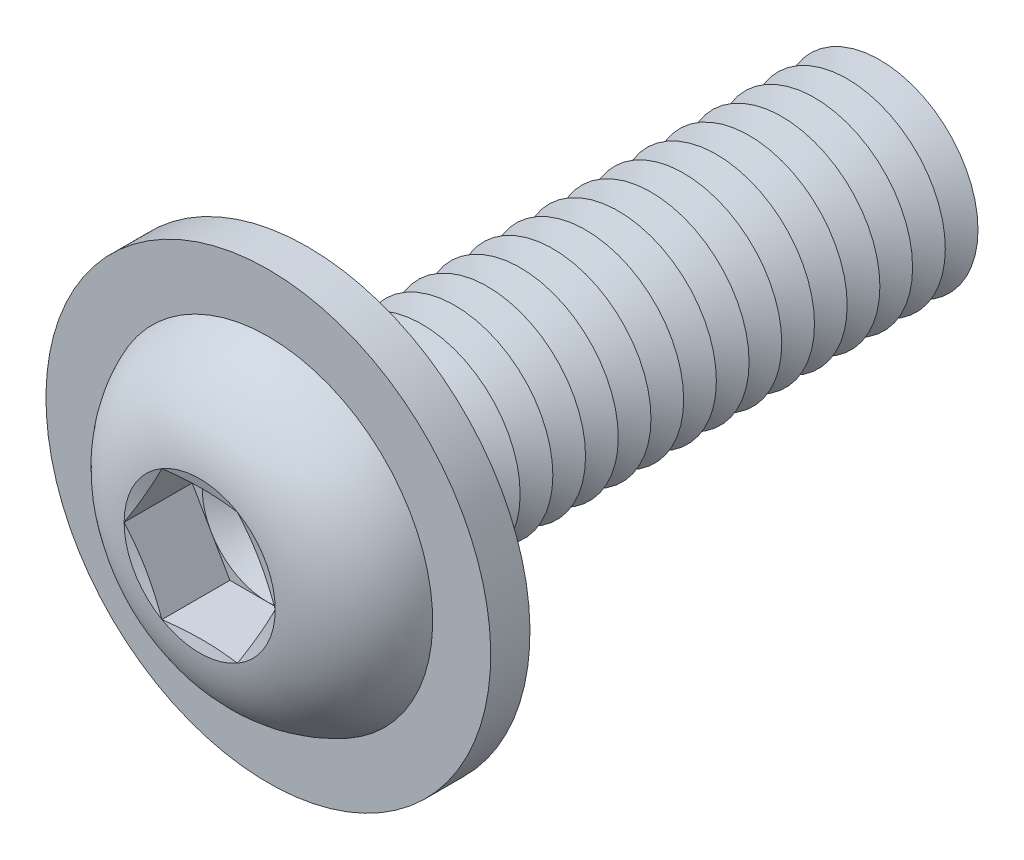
ISO-10303-21;
HEADER;
FILE_DESCRIPTION(('STEP AP214'),'2;1');
FILE_NAME('part.step','',(''),(''),'','','');
FILE_SCHEMA(('AUTOMOTIVE_DESIGN { 1 0 10303 214 1 1 1 1 }'));
ENDSEC;
DATA;
#1=APPLICATION_CONTEXT('core data for automotive mechanical design processes');
#2=APPLICATION_PROTOCOL_DEFINITION('international standard','automotive_design',2000,#1);
#3=PRODUCT_CONTEXT('',#1,'mechanical');
#4=PRODUCT('Part','Part','',(#3));
#5=PRODUCT_RELATED_PRODUCT_CATEGORY('part','',(#4));
#6=PRODUCT_DEFINITION_FORMATION('','',#4);
#7=PRODUCT_DEFINITION_CONTEXT('part definition',#1,'design');
#8=PRODUCT_DEFINITION('design','',#6,#7);
#9=PRODUCT_DEFINITION_SHAPE('','',#8);
#10=(LENGTH_UNIT() NAMED_UNIT(*) SI_UNIT(.MILLI.,.METRE.));
#11=(NAMED_UNIT(*) PLANE_ANGLE_UNIT() SI_UNIT($,.RADIAN.));
#12=(NAMED_UNIT(*) SI_UNIT($,.STERADIAN.) SOLID_ANGLE_UNIT());
#13=UNCERTAINTY_MEASURE_WITH_UNIT(LENGTH_MEASURE(1.E-05),#10,'distance_accuracy_value','');
#14=(GEOMETRIC_REPRESENTATION_CONTEXT(3) GLOBAL_UNCERTAINTY_ASSIGNED_CONTEXT((#13)) GLOBAL_UNIT_ASSIGNED_CONTEXT((#10,
#11,#12)) REPRESENTATION_CONTEXT('',''));
#15=CARTESIAN_POINT('',(0.,0.,0.));
#16=DIRECTION('',(0.,0.,1.));
#17=DIRECTION('',(1.,0.,0.));
#18=AXIS2_PLACEMENT_3D('',#15,#16,#17);
#19=CARTESIAN_POINT('',(0.,0.,-14.5));
#20=DIRECTION('',(0.,0.,1.));
#21=DIRECTION('',(1.,0.,0.));
#22=AXIS2_PLACEMENT_3D('',#19,#20,#21);
#23=CONICAL_SURFACE('',#22,3.00000000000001,1.0471975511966);
#24=CARTESIAN_POINT('',(0.,0.,-15.));
#25=DIRECTION('',(0.,0.,1.));
#26=DIRECTION('',(1.,0.,0.));
#27=AXIS2_PLACEMENT_3D('',#24,#25,#26);
#28=CIRCLE('',#27,2.13397459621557);
#29=CARTESIAN_POINT('',(2.13397459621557,0.,-15.));
#30=VERTEX_POINT('',#29);
#31=EDGE_CURVE('E354',#30,#30,#28,.T.);
#32=ORIENTED_EDGE('',*,*,#31,.T.);
#33=EDGE_LOOP('',(#32));
#34=FACE_BOUND('',#33,.T.);
#35=CARTESIAN_POINT('',(0.,0.,-14.5));
#36=DIRECTION('',(0.,0.,1.));
#37=DIRECTION('',(1.,0.,0.));
#38=AXIS2_PLACEMENT_3D('',#35,#36,#37);
#39=CIRCLE('',#38,3.00000000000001);
#40=CARTESIAN_POINT('',(3.00000000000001,0.,-14.5));
#41=VERTEX_POINT('',#40);
#42=EDGE_CURVE('E350',#41,#41,#39,.T.);
#43=ORIENTED_EDGE('',*,*,#42,.F.);
#44=EDGE_LOOP('',(#43));
#45=FACE_BOUND('',#44,.T.);
#46=ADVANCED_FACE('F39',(#34,#45),#23,.T.);
#47=CARTESIAN_POINT('',(0.,0.,-15.));
#48=DIRECTION('',(0.,0.,-1.));
#49=DIRECTION('',(-1.,0.,0.));
#50=AXIS2_PLACEMENT_3D('',#47,#48,#49);
#51=CONICAL_SURFACE('',#50,2.13397459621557,1.0471975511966);
#52=CARTESIAN_POINT('',(0.,0.,-15.5));
#53=DIRECTION('',(0.,0.,1.));
#54=DIRECTION('',(1.,0.,0.));
#55=AXIS2_PLACEMENT_3D('',#52,#53,#54);
#56=CIRCLE('',#55,3.00000000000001);
#57=CARTESIAN_POINT('',(3.00000000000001,0.,-15.5));
#58=VERTEX_POINT('',#57);
#59=EDGE_CURVE('E358',#58,#58,#56,.T.);
#60=ORIENTED_EDGE('',*,*,#59,.T.);
#61=EDGE_LOOP('',(#60));
#62=FACE_BOUND('',#61,.T.);
#63=ORIENTED_EDGE('',*,*,#31,.F.);
#64=EDGE_LOOP('',(#63));
#65=FACE_BOUND('',#64,.T.);
#66=ADVANCED_FACE('F485',(#62,#65),#51,.T.);
#67=CARTESIAN_POINT('',(0.,3.00000000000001,-18.));
#68=DIRECTION('',(0.,0.,-1.));
#69=DIRECTION('',(-1.,0.,0.));
#70=AXIS2_PLACEMENT_3D('',#67,#68,#69);
#71=PLANE('',#70);
#72=CARTESIAN_POINT('',(0.,0.,-18.));
#73=DIRECTION('',(0.,0.,1.));
#74=DIRECTION('',(1.,0.,0.));
#75=AXIS2_PLACEMENT_3D('',#72,#73,#74);
#76=CIRCLE('',#75,2.13397459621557);
#77=CARTESIAN_POINT('',(2.13397459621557,0.,-18.));
#78=VERTEX_POINT('',#77);
#79=EDGE_CURVE('E378',#78,#78,#76,.T.);
#80=ORIENTED_EDGE('',*,*,#79,.F.);
#81=EDGE_LOOP('',(#80));
#82=FACE_BOUND('',#81,.T.);
#83=ADVANCED_FACE('F491',(#82),#71,.T.);
#84=CARTESIAN_POINT('',(0.,0.,-17.5));
#85=DIRECTION('',(0.,0.,1.));
#86=DIRECTION('',(1.,0.,0.));
#87=AXIS2_PLACEMENT_3D('',#84,#85,#86);
#88=CONICAL_SURFACE('',#87,3.00000000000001,1.0471975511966);
#89=ORIENTED_EDGE('',*,*,#79,.T.);
#90=EDGE_LOOP('',(#89));
#91=FACE_BOUND('',#90,.T.);
#92=CARTESIAN_POINT('',(0.,0.,-17.5));
#93=DIRECTION('',(0.,0.,1.));
#94=DIRECTION('',(1.,0.,0.));
#95=AXIS2_PLACEMENT_3D('',#92,#93,#94);
#96=CIRCLE('',#95,3.00000000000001);
#97=CARTESIAN_POINT('',(3.00000000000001,0.,-17.5));
#98=VERTEX_POINT('',#97);
#99=EDGE_CURVE('E374',#98,#98,#96,.T.);
#100=ORIENTED_EDGE('',*,*,#99,.F.);
#101=EDGE_LOOP('',(#100));
#102=FACE_BOUND('',#101,.T.);
#103=ADVANCED_FACE('F510',(#91,#102),#88,.T.);
#104=CARTESIAN_POINT('',(0.,0.,-17.));
#105=DIRECTION('',(0.,0.,-1.));
#106=DIRECTION('',(-1.,0.,0.));
#107=AXIS2_PLACEMENT_3D('',#104,#105,#106);
#108=CONICAL_SURFACE('',#107,2.13397459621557,1.0471975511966);
#109=ORIENTED_EDGE('',*,*,#99,.T.);
#110=EDGE_LOOP('',(#109));
#111=FACE_BOUND('',#110,.T.);
#112=CARTESIAN_POINT('',(0.,0.,-17.));
#113=DIRECTION('',(0.,0.,1.));
#114=DIRECTION('',(1.,0.,0.));
#115=AXIS2_PLACEMENT_3D('',#112,#113,#114);
#116=CIRCLE('',#115,2.13397459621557);
#117=CARTESIAN_POINT('',(2.13397459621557,0.,-17.));
#118=VERTEX_POINT('',#117);
#119=EDGE_CURVE('E370',#118,#118,#116,.T.);
#120=ORIENTED_EDGE('',*,*,#119,.F.);
#121=EDGE_LOOP('',(#120));
#122=FACE_BOUND('',#121,.T.);
#123=ADVANCED_FACE('F507',(#111,#122),#108,.T.);
#124=CARTESIAN_POINT('',(0.,0.,-16.5));
#125=DIRECTION('',(0.,0.,1.));
#126=DIRECTION('',(1.,0.,0.));
#127=AXIS2_PLACEMENT_3D('',#124,#125,#126);
#128=CONICAL_SURFACE('',#127,3.00000000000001,1.0471975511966);
#129=ORIENTED_EDGE('',*,*,#119,.T.);
#130=EDGE_LOOP('',(#129));
#131=FACE_BOUND('',#130,.T.);
#132=CARTESIAN_POINT('',(0.,0.,-16.5));
#133=DIRECTION('',(0.,0.,1.));
#134=DIRECTION('',(1.,0.,0.));
#135=AXIS2_PLACEMENT_3D('',#132,#133,#134);
#136=CIRCLE('',#135,3.00000000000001);
#137=CARTESIAN_POINT('',(3.00000000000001,0.,-16.5));
#138=VERTEX_POINT('',#137);
#139=EDGE_CURVE('E366',#138,#138,#136,.T.);
#140=ORIENTED_EDGE('',*,*,#139,.F.);
#141=EDGE_LOOP('',(#140));
#142=FACE_BOUND('',#141,.T.);
#143=ADVANCED_FACE('F501',(#131,#142),#128,.T.);
#144=CARTESIAN_POINT('',(0.,0.,-16.));
#145=DIRECTION('',(0.,0.,-1.));
#146=DIRECTION('',(-1.,0.,0.));
#147=AXIS2_PLACEMENT_3D('',#144,#145,#146);
#148=CONICAL_SURFACE('',#147,2.13397459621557,1.0471975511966);
#149=ORIENTED_EDGE('',*,*,#139,.T.);
#150=EDGE_LOOP('',(#149));
#151=FACE_BOUND('',#150,.T.);
#152=CARTESIAN_POINT('',(0.,0.,-16.));
#153=DIRECTION('',(0.,0.,1.));
#154=DIRECTION('',(1.,0.,0.));
#155=AXIS2_PLACEMENT_3D('',#152,#153,#154);
#156=CIRCLE('',#155,2.13397459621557);
#157=CARTESIAN_POINT('',(2.13397459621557,0.,-16.));
#158=VERTEX_POINT('',#157);
#159=EDGE_CURVE('E362',#158,#158,#156,.T.);
#160=ORIENTED_EDGE('',*,*,#159,.F.);
#161=EDGE_LOOP('',(#160));
#162=FACE_BOUND('',#161,.T.);
#163=ADVANCED_FACE('F497',(#151,#162),#148,.T.);
#164=CARTESIAN_POINT('',(0.,0.,-15.5));
#165=DIRECTION('',(0.,0.,1.));
#166=DIRECTION('',(1.,0.,0.));
#167=AXIS2_PLACEMENT_3D('',#164,#165,#166);
#168=CONICAL_SURFACE('',#167,3.00000000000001,1.0471975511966);
#169=ORIENTED_EDGE('',*,*,#159,.T.);
#170=EDGE_LOOP('',(#169));
#171=FACE_BOUND('',#170,.T.);
#172=ORIENTED_EDGE('',*,*,#59,.F.);
#173=EDGE_LOOP('',(#172));
#174=FACE_BOUND('',#173,.T.);
#175=ADVANCED_FACE('F500',(#171,#174),#168,.T.);
#176=CARTESIAN_POINT('',(0.,0.,-13.5));
#177=DIRECTION('',(0.,0.,1.));
#178=DIRECTION('',(1.,0.,0.));
#179=AXIS2_PLACEMENT_3D('',#176,#177,#178);
#180=CONICAL_SURFACE('',#179,3.00000000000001,1.0471975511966);
#181=CARTESIAN_POINT('',(0.,0.,-14.));
#182=DIRECTION('',(0.,0.,1.));
#183=DIRECTION('',(1.,0.,0.));
#184=AXIS2_PLACEMENT_3D('',#181,#182,#183);
#185=CIRCLE('',#184,2.13397459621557);
#186=CARTESIAN_POINT('',(2.13397459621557,0.,-14.));
#187=VERTEX_POINT('',#186);
#188=EDGE_CURVE('E346',#187,#187,#185,.T.);
#189=ORIENTED_EDGE('',*,*,#188,.T.);
#190=EDGE_LOOP('',(#189));
#191=FACE_BOUND('',#190,.T.);
#192=CARTESIAN_POINT('',(0.,0.,-13.5));
#193=DIRECTION('',(0.,0.,1.));
#194=DIRECTION('',(1.,0.,0.));
#195=AXIS2_PLACEMENT_3D('',#192,#193,#194);
#196=CIRCLE('',#195,3.00000000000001);
#197=CARTESIAN_POINT('',(3.00000000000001,0.,-13.5));
#198=VERTEX_POINT('',#197);
#199=EDGE_CURVE('E342',#198,#198,#196,.T.);
#200=ORIENTED_EDGE('',*,*,#199,.F.);
#201=EDGE_LOOP('',(#200));
#202=FACE_BOUND('',#201,.T.);
#203=ADVANCED_FACE('F505',(#191,#202),#180,.T.);
#204=CARTESIAN_POINT('',(0.,0.,-14.));
#205=DIRECTION('',(0.,0.,-1.));
#206=DIRECTION('',(-1.,0.,0.));
#207=AXIS2_PLACEMENT_3D('',#204,#205,#206);
#208=CONICAL_SURFACE('',#207,2.13397459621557,1.0471975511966);
#209=ORIENTED_EDGE('',*,*,#42,.T.);
#210=EDGE_LOOP('',(#209));
#211=FACE_BOUND('',#210,.T.);
#212=ORIENTED_EDGE('',*,*,#188,.F.);
#213=EDGE_LOOP('',(#212));
#214=FACE_BOUND('',#213,.T.);
#215=ADVANCED_FACE('F556',(#211,#214),#208,.T.);
#216=CARTESIAN_POINT('',(0.,0.,-12.5));
#217=DIRECTION('',(0.,0.,1.));
#218=DIRECTION('',(1.,0.,0.));
#219=AXIS2_PLACEMENT_3D('',#216,#217,#218);
#220=CONICAL_SURFACE('',#219,3.00000000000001,1.0471975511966);
#221=CARTESIAN_POINT('',(0.,0.,-13.));
#222=DIRECTION('',(0.,0.,1.));
#223=DIRECTION('',(1.,0.,0.));
#224=AXIS2_PLACEMENT_3D('',#221,#222,#223);
#225=CIRCLE('',#224,2.13397459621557);
#226=CARTESIAN_POINT('',(2.13397459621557,0.,-13.));
#227=VERTEX_POINT('',#226);
#228=EDGE_CURVE('E338',#227,#227,#225,.T.);
#229=ORIENTED_EDGE('',*,*,#228,.T.);
#230=EDGE_LOOP('',(#229));
#231=FACE_BOUND('',#230,.T.);
#232=CARTESIAN_POINT('',(0.,0.,-12.5));
#233=DIRECTION('',(0.,0.,1.));
#234=DIRECTION('',(1.,0.,0.));
#235=AXIS2_PLACEMENT_3D('',#232,#233,#234);
#236=CIRCLE('',#235,3.00000000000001);
#237=CARTESIAN_POINT('',(3.00000000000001,0.,-12.5));
#238=VERTEX_POINT('',#237);
#239=EDGE_CURVE('E334',#238,#238,#236,.T.);
#240=ORIENTED_EDGE('',*,*,#239,.F.);
#241=EDGE_LOOP('',(#240));
#242=FACE_BOUND('',#241,.T.);
#243=ADVANCED_FACE('F562',(#231,#242),#220,.T.);
#244=CARTESIAN_POINT('',(0.,0.,-13.));
#245=DIRECTION('',(0.,0.,-1.));
#246=DIRECTION('',(-1.,0.,0.));
#247=AXIS2_PLACEMENT_3D('',#244,#245,#246);
#248=CONICAL_SURFACE('',#247,2.13397459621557,1.0471975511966);
#249=ORIENTED_EDGE('',*,*,#199,.T.);
#250=EDGE_LOOP('',(#249));
#251=FACE_BOUND('',#250,.T.);
#252=ORIENTED_EDGE('',*,*,#228,.F.);
#253=EDGE_LOOP('',(#252));
#254=FACE_BOUND('',#253,.T.);
#255=ADVANCED_FACE('F569',(#251,#254),#248,.T.);
#256=CARTESIAN_POINT('',(0.,0.,-11.5));
#257=DIRECTION('',(0.,0.,1.));
#258=DIRECTION('',(1.,0.,0.));
#259=AXIS2_PLACEMENT_3D('',#256,#257,#258);
#260=CONICAL_SURFACE('',#259,3.00000000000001,1.0471975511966);
#261=CARTESIAN_POINT('',(0.,0.,-12.));
#262=DIRECTION('',(0.,0.,1.));
#263=DIRECTION('',(1.,0.,0.));
#264=AXIS2_PLACEMENT_3D('',#261,#262,#263);
#265=CIRCLE('',#264,2.13397459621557);
#266=CARTESIAN_POINT('',(2.13397459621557,0.,-12.));
#267=VERTEX_POINT('',#266);
#268=EDGE_CURVE('E330',#267,#267,#265,.T.);
#269=ORIENTED_EDGE('',*,*,#268,.T.);
#270=EDGE_LOOP('',(#269));
#271=FACE_BOUND('',#270,.T.);
#272=CARTESIAN_POINT('',(0.,0.,-11.5));
#273=DIRECTION('',(0.,0.,1.));
#274=DIRECTION('',(1.,0.,0.));
#275=AXIS2_PLACEMENT_3D('',#272,#273,#274);
#276=CIRCLE('',#275,3.00000000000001);
#277=CARTESIAN_POINT('',(3.00000000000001,0.,-11.5));
#278=VERTEX_POINT('',#277);
#279=EDGE_CURVE('E326',#278,#278,#276,.T.);
#280=ORIENTED_EDGE('',*,*,#279,.F.);
#281=EDGE_LOOP('',(#280));
#282=FACE_BOUND('',#281,.T.);
#283=ADVANCED_FACE('F576',(#271,#282),#260,.T.);
#284=CARTESIAN_POINT('',(0.,0.,-12.));
#285=DIRECTION('',(0.,0.,-1.));
#286=DIRECTION('',(-1.,0.,0.));
#287=AXIS2_PLACEMENT_3D('',#284,#285,#286);
#288=CONICAL_SURFACE('',#287,2.13397459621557,1.0471975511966);
#289=ORIENTED_EDGE('',*,*,#239,.T.);
#290=EDGE_LOOP('',(#289));
#291=FACE_BOUND('',#290,.T.);
#292=ORIENTED_EDGE('',*,*,#268,.F.);
#293=EDGE_LOOP('',(#292));
#294=FACE_BOUND('',#293,.T.);
#295=ADVANCED_FACE('F583',(#291,#294),#288,.T.);
#296=CARTESIAN_POINT('',(0.,0.,-10.5));
#297=DIRECTION('',(0.,0.,1.));
#298=DIRECTION('',(1.,0.,0.));
#299=AXIS2_PLACEMENT_3D('',#296,#297,#298);
#300=CONICAL_SURFACE('',#299,3.00000000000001,1.0471975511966);
#301=CARTESIAN_POINT('',(0.,0.,-11.));
#302=DIRECTION('',(0.,0.,1.));
#303=DIRECTION('',(1.,0.,0.));
#304=AXIS2_PLACEMENT_3D('',#301,#302,#303);
#305=CIRCLE('',#304,2.13397459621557);
#306=CARTESIAN_POINT('',(2.13397459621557,0.,-11.));
#307=VERTEX_POINT('',#306);
#308=EDGE_CURVE('E322',#307,#307,#305,.T.);
#309=ORIENTED_EDGE('',*,*,#308,.T.);
#310=EDGE_LOOP('',(#309));
#311=FACE_BOUND('',#310,.T.);
#312=CARTESIAN_POINT('',(0.,0.,-10.5));
#313=DIRECTION('',(0.,0.,1.));
#314=DIRECTION('',(1.,0.,0.));
#315=AXIS2_PLACEMENT_3D('',#312,#313,#314);
#316=CIRCLE('',#315,3.00000000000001);
#317=CARTESIAN_POINT('',(3.00000000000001,0.,-10.5));
#318=VERTEX_POINT('',#317);
#319=EDGE_CURVE('E318',#318,#318,#316,.T.);
#320=ORIENTED_EDGE('',*,*,#319,.F.);
#321=EDGE_LOOP('',(#320));
#322=FACE_BOUND('',#321,.T.);
#323=ADVANCED_FACE('F590',(#311,#322),#300,.T.);
#324=CARTESIAN_POINT('',(0.,0.,-11.));
#325=DIRECTION('',(0.,0.,-1.));
#326=DIRECTION('',(-1.,0.,0.));
#327=AXIS2_PLACEMENT_3D('',#324,#325,#326);
#328=CONICAL_SURFACE('',#327,2.13397459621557,1.0471975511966);
#329=ORIENTED_EDGE('',*,*,#279,.T.);
#330=EDGE_LOOP('',(#329));
#331=FACE_BOUND('',#330,.T.);
#332=ORIENTED_EDGE('',*,*,#308,.F.);
#333=EDGE_LOOP('',(#332));
#334=FACE_BOUND('',#333,.T.);
#335=ADVANCED_FACE('F597',(#331,#334),#328,.T.);
#336=CARTESIAN_POINT('',(0.,0.,-9.5));
#337=DIRECTION('',(0.,0.,1.));
#338=DIRECTION('',(1.,0.,0.));
#339=AXIS2_PLACEMENT_3D('',#336,#337,#338);
#340=CONICAL_SURFACE('',#339,3.00000000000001,1.0471975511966);
#341=CARTESIAN_POINT('',(0.,0.,-10.));
#342=DIRECTION('',(0.,0.,1.));
#343=DIRECTION('',(1.,0.,0.));
#344=AXIS2_PLACEMENT_3D('',#341,#342,#343);
#345=CIRCLE('',#344,2.13397459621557);
#346=CARTESIAN_POINT('',(2.13397459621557,0.,-10.));
#347=VERTEX_POINT('',#346);
#348=EDGE_CURVE('E314',#347,#347,#345,.T.);
#349=ORIENTED_EDGE('',*,*,#348,.T.);
#350=EDGE_LOOP('',(#349));
#351=FACE_BOUND('',#350,.T.);
#352=CARTESIAN_POINT('',(0.,0.,-9.5));
#353=DIRECTION('',(0.,0.,1.));
#354=DIRECTION('',(1.,0.,0.));
#355=AXIS2_PLACEMENT_3D('',#352,#353,#354);
#356=CIRCLE('',#355,3.00000000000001);
#357=CARTESIAN_POINT('',(3.00000000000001,0.,-9.5));
#358=VERTEX_POINT('',#357);
#359=EDGE_CURVE('E310',#358,#358,#356,.T.);
#360=ORIENTED_EDGE('',*,*,#359,.F.);
#361=EDGE_LOOP('',(#360));
#362=FACE_BOUND('',#361,.T.);
#363=ADVANCED_FACE('F604',(#351,#362),#340,.T.);
#364=CARTESIAN_POINT('',(0.,0.,-10.));
#365=DIRECTION('',(0.,0.,-1.));
#366=DIRECTION('',(-1.,0.,0.));
#367=AXIS2_PLACEMENT_3D('',#364,#365,#366);
#368=CONICAL_SURFACE('',#367,2.13397459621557,1.0471975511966);
#369=ORIENTED_EDGE('',*,*,#319,.T.);
#370=EDGE_LOOP('',(#369));
#371=FACE_BOUND('',#370,.T.);
#372=ORIENTED_EDGE('',*,*,#348,.F.);
#373=EDGE_LOOP('',(#372));
#374=FACE_BOUND('',#373,.T.);
#375=ADVANCED_FACE('F611',(#371,#374),#368,.T.);
#376=CARTESIAN_POINT('',(0.,0.,-8.5));
#377=DIRECTION('',(0.,0.,1.));
#378=DIRECTION('',(1.,0.,0.));
#379=AXIS2_PLACEMENT_3D('',#376,#377,#378);
#380=CONICAL_SURFACE('',#379,3.00000000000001,1.0471975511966);
#381=CARTESIAN_POINT('',(0.,0.,-9.));
#382=DIRECTION('',(0.,0.,1.));
#383=DIRECTION('',(1.,0.,0.));
#384=AXIS2_PLACEMENT_3D('',#381,#382,#383);
#385=CIRCLE('',#384,2.13397459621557);
#386=CARTESIAN_POINT('',(2.13397459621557,0.,-9.));
#387=VERTEX_POINT('',#386);
#388=EDGE_CURVE('E306',#387,#387,#385,.T.);
#389=ORIENTED_EDGE('',*,*,#388,.T.);
#390=EDGE_LOOP('',(#389));
#391=FACE_BOUND('',#390,.T.);
#392=CARTESIAN_POINT('',(0.,0.,-8.5));
#393=DIRECTION('',(0.,0.,1.));
#394=DIRECTION('',(1.,0.,0.));
#395=AXIS2_PLACEMENT_3D('',#392,#393,#394);
#396=CIRCLE('',#395,3.00000000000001);
#397=CARTESIAN_POINT('',(3.00000000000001,0.,-8.5));
#398=VERTEX_POINT('',#397);
#399=EDGE_CURVE('E302',#398,#398,#396,.T.);
#400=ORIENTED_EDGE('',*,*,#399,.F.);
#401=EDGE_LOOP('',(#400));
#402=FACE_BOUND('',#401,.T.);
#403=ADVANCED_FACE('F618',(#391,#402),#380,.T.);
#404=CARTESIAN_POINT('',(0.,0.,-9.));
#405=DIRECTION('',(0.,0.,-1.));
#406=DIRECTION('',(-1.,0.,0.));
#407=AXIS2_PLACEMENT_3D('',#404,#405,#406);
#408=CONICAL_SURFACE('',#407,2.13397459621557,1.0471975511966);
#409=ORIENTED_EDGE('',*,*,#359,.T.);
#410=EDGE_LOOP('',(#409));
#411=FACE_BOUND('',#410,.T.);
#412=ORIENTED_EDGE('',*,*,#388,.F.);
#413=EDGE_LOOP('',(#412));
#414=FACE_BOUND('',#413,.T.);
#415=ADVANCED_FACE('F625',(#411,#414),#408,.T.);
#416=CARTESIAN_POINT('',(0.,0.,-7.5));
#417=DIRECTION('',(0.,0.,1.));
#418=DIRECTION('',(1.,0.,0.));
#419=AXIS2_PLACEMENT_3D('',#416,#417,#418);
#420=CONICAL_SURFACE('',#419,3.00000000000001,1.0471975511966);
#421=CARTESIAN_POINT('',(0.,0.,-8.));
#422=DIRECTION('',(0.,0.,1.));
#423=DIRECTION('',(1.,0.,0.));
#424=AXIS2_PLACEMENT_3D('',#421,#422,#423);
#425=CIRCLE('',#424,2.13397459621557);
#426=CARTESIAN_POINT('',(2.13397459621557,0.,-8.));
#427=VERTEX_POINT('',#426);
#428=EDGE_CURVE('E298',#427,#427,#425,.T.);
#429=ORIENTED_EDGE('',*,*,#428,.T.);
#430=EDGE_LOOP('',(#429));
#431=FACE_BOUND('',#430,.T.);
#432=CARTESIAN_POINT('',(0.,0.,-7.5));
#433=DIRECTION('',(0.,0.,1.));
#434=DIRECTION('',(1.,0.,0.));
#435=AXIS2_PLACEMENT_3D('',#432,#433,#434);
#436=CIRCLE('',#435,3.00000000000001);
#437=CARTESIAN_POINT('',(3.00000000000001,0.,-7.5));
#438=VERTEX_POINT('',#437);
#439=EDGE_CURVE('E294',#438,#438,#436,.T.);
#440=ORIENTED_EDGE('',*,*,#439,.F.);
#441=EDGE_LOOP('',(#440));
#442=FACE_BOUND('',#441,.T.);
#443=ADVANCED_FACE('F632',(#431,#442),#420,.T.);
#444=CARTESIAN_POINT('',(0.,0.,-8.));
#445=DIRECTION('',(0.,0.,-1.));
#446=DIRECTION('',(-1.,0.,0.));
#447=AXIS2_PLACEMENT_3D('',#444,#445,#446);
#448=CONICAL_SURFACE('',#447,2.13397459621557,1.0471975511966);
#449=ORIENTED_EDGE('',*,*,#399,.T.);
#450=EDGE_LOOP('',(#449));
#451=FACE_BOUND('',#450,.T.);
#452=ORIENTED_EDGE('',*,*,#428,.F.);
#453=EDGE_LOOP('',(#452));
#454=FACE_BOUND('',#453,.T.);
#455=ADVANCED_FACE('F639',(#451,#454),#448,.T.);
#456=CARTESIAN_POINT('',(0.,0.,-6.5));
#457=DIRECTION('',(0.,0.,1.));
#458=DIRECTION('',(1.,0.,0.));
#459=AXIS2_PLACEMENT_3D('',#456,#457,#458);
#460=CONICAL_SURFACE('',#459,3.00000000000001,1.0471975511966);
#461=CARTESIAN_POINT('',(0.,0.,-7.));
#462=DIRECTION('',(0.,0.,1.));
#463=DIRECTION('',(1.,0.,0.));
#464=AXIS2_PLACEMENT_3D('',#461,#462,#463);
#465=CIRCLE('',#464,2.13397459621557);
#466=CARTESIAN_POINT('',(2.13397459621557,0.,-7.));
#467=VERTEX_POINT('',#466);
#468=EDGE_CURVE('E290',#467,#467,#465,.T.);
#469=ORIENTED_EDGE('',*,*,#468,.T.);
#470=EDGE_LOOP('',(#469));
#471=FACE_BOUND('',#470,.T.);
#472=CARTESIAN_POINT('',(0.,0.,-6.5));
#473=DIRECTION('',(0.,0.,1.));
#474=DIRECTION('',(1.,0.,0.));
#475=AXIS2_PLACEMENT_3D('',#472,#473,#474);
#476=CIRCLE('',#475,3.00000000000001);
#477=CARTESIAN_POINT('',(3.00000000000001,0.,-6.5));
#478=VERTEX_POINT('',#477);
#479=EDGE_CURVE('E286',#478,#478,#476,.T.);
#480=ORIENTED_EDGE('',*,*,#479,.F.);
#481=EDGE_LOOP('',(#480));
#482=FACE_BOUND('',#481,.T.);
#483=ADVANCED_FACE('F646',(#471,#482),#460,.T.);
#484=CARTESIAN_POINT('',(0.,0.,-7.));
#485=DIRECTION('',(0.,0.,-1.));
#486=DIRECTION('',(-1.,0.,0.));
#487=AXIS2_PLACEMENT_3D('',#484,#485,#486);
#488=CONICAL_SURFACE('',#487,2.13397459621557,1.0471975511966);
#489=ORIENTED_EDGE('',*,*,#439,.T.);
#490=EDGE_LOOP('',(#489));
#491=FACE_BOUND('',#490,.T.);
#492=ORIENTED_EDGE('',*,*,#468,.F.);
#493=EDGE_LOOP('',(#492));
#494=FACE_BOUND('',#493,.T.);
#495=ADVANCED_FACE('F653',(#491,#494),#488,.T.);
#496=CARTESIAN_POINT('',(0.,0.,-5.5));
#497=DIRECTION('',(0.,0.,1.));
#498=DIRECTION('',(1.,0.,0.));
#499=AXIS2_PLACEMENT_3D('',#496,#497,#498);
#500=CONICAL_SURFACE('',#499,3.00000000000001,1.0471975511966);
#501=CARTESIAN_POINT('',(0.,0.,-6.));
#502=DIRECTION('',(0.,0.,1.));
#503=DIRECTION('',(1.,0.,0.));
#504=AXIS2_PLACEMENT_3D('',#501,#502,#503);
#505=CIRCLE('',#504,2.13397459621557);
#506=CARTESIAN_POINT('',(2.13397459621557,0.,-6.));
#507=VERTEX_POINT('',#506);
#508=EDGE_CURVE('E282',#507,#507,#505,.T.);
#509=ORIENTED_EDGE('',*,*,#508,.T.);
#510=EDGE_LOOP('',(#509));
#511=FACE_BOUND('',#510,.T.);
#512=CARTESIAN_POINT('',(0.,0.,-5.5));
#513=DIRECTION('',(0.,0.,1.));
#514=DIRECTION('',(1.,0.,0.));
#515=AXIS2_PLACEMENT_3D('',#512,#513,#514);
#516=CIRCLE('',#515,3.00000000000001);
#517=CARTESIAN_POINT('',(3.00000000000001,0.,-5.5));
#518=VERTEX_POINT('',#517);
#519=EDGE_CURVE('E278',#518,#518,#516,.T.);
#520=ORIENTED_EDGE('',*,*,#519,.F.);
#521=EDGE_LOOP('',(#520));
#522=FACE_BOUND('',#521,.T.);
#523=ADVANCED_FACE('F660',(#511,#522),#500,.T.);
#524=CARTESIAN_POINT('',(0.,0.,-6.));
#525=DIRECTION('',(0.,0.,-1.));
#526=DIRECTION('',(-1.,0.,0.));
#527=AXIS2_PLACEMENT_3D('',#524,#525,#526);
#528=CONICAL_SURFACE('',#527,2.13397459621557,1.0471975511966);
#529=ORIENTED_EDGE('',*,*,#479,.T.);
#530=EDGE_LOOP('',(#529));
#531=FACE_BOUND('',#530,.T.);
#532=ORIENTED_EDGE('',*,*,#508,.F.);
#533=EDGE_LOOP('',(#532));
#534=FACE_BOUND('',#533,.T.);
#535=ADVANCED_FACE('F667',(#531,#534),#528,.T.);
#536=CARTESIAN_POINT('',(0.,0.,-4.5));
#537=DIRECTION('',(0.,0.,1.));
#538=DIRECTION('',(1.,0.,0.));
#539=AXIS2_PLACEMENT_3D('',#536,#537,#538);
#540=CONICAL_SURFACE('',#539,3.00000000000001,1.0471975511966);
#541=CARTESIAN_POINT('',(0.,0.,-5.));
#542=DIRECTION('',(0.,0.,1.));
#543=DIRECTION('',(1.,0.,0.));
#544=AXIS2_PLACEMENT_3D('',#541,#542,#543);
#545=CIRCLE('',#544,2.13397459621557);
#546=CARTESIAN_POINT('',(2.13397459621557,0.,-5.));
#547=VERTEX_POINT('',#546);
#548=EDGE_CURVE('E274',#547,#547,#545,.T.);
#549=ORIENTED_EDGE('',*,*,#548,.T.);
#550=EDGE_LOOP('',(#549));
#551=FACE_BOUND('',#550,.T.);
#552=CARTESIAN_POINT('',(0.,0.,-4.5));
#553=DIRECTION('',(0.,0.,1.));
#554=DIRECTION('',(1.,0.,0.));
#555=AXIS2_PLACEMENT_3D('',#552,#553,#554);
#556=CIRCLE('',#555,3.00000000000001);
#557=CARTESIAN_POINT('',(3.00000000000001,0.,-4.5));
#558=VERTEX_POINT('',#557);
#559=EDGE_CURVE('E270',#558,#558,#556,.T.);
#560=ORIENTED_EDGE('',*,*,#559,.F.);
#561=EDGE_LOOP('',(#560));
#562=FACE_BOUND('',#561,.T.);
#563=ADVANCED_FACE('F674',(#551,#562),#540,.T.);
#564=CARTESIAN_POINT('',(0.,0.,-5.));
#565=DIRECTION('',(0.,0.,-1.));
#566=DIRECTION('',(-1.,0.,0.));
#567=AXIS2_PLACEMENT_3D('',#564,#565,#566);
#568=CONICAL_SURFACE('',#567,2.13397459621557,1.0471975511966);
#569=ORIENTED_EDGE('',*,*,#519,.T.);
#570=EDGE_LOOP('',(#569));
#571=FACE_BOUND('',#570,.T.);
#572=ORIENTED_EDGE('',*,*,#548,.F.);
#573=EDGE_LOOP('',(#572));
#574=FACE_BOUND('',#573,.T.);
#575=ADVANCED_FACE('F681',(#571,#574),#568,.T.);
#576=CARTESIAN_POINT('',(0.,0.,-3.5));
#577=DIRECTION('',(0.,0.,1.));
#578=DIRECTION('',(1.,0.,0.));
#579=AXIS2_PLACEMENT_3D('',#576,#577,#578);
#580=CONICAL_SURFACE('',#579,3.00000000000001,1.0471975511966);
#581=CARTESIAN_POINT('',(0.,0.,-4.));
#582=DIRECTION('',(0.,0.,1.));
#583=DIRECTION('',(1.,0.,0.));
#584=AXIS2_PLACEMENT_3D('',#581,#582,#583);
#585=CIRCLE('',#584,2.13397459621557);
#586=CARTESIAN_POINT('',(2.13397459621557,0.,-4.));
#587=VERTEX_POINT('',#586);
#588=EDGE_CURVE('E266',#587,#587,#585,.T.);
#589=ORIENTED_EDGE('',*,*,#588,.T.);
#590=EDGE_LOOP('',(#589));
#591=FACE_BOUND('',#590,.T.);
#592=CARTESIAN_POINT('',(0.,0.,-3.5));
#593=DIRECTION('',(0.,0.,1.));
#594=DIRECTION('',(1.,0.,0.));
#595=AXIS2_PLACEMENT_3D('',#592,#593,#594);
#596=CIRCLE('',#595,3.00000000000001);
#597=CARTESIAN_POINT('',(3.00000000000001,0.,-3.5));
#598=VERTEX_POINT('',#597);
#599=EDGE_CURVE('E262',#598,#598,#596,.T.);
#600=ORIENTED_EDGE('',*,*,#599,.F.);
#601=EDGE_LOOP('',(#600));
#602=FACE_BOUND('',#601,.T.);
#603=ADVANCED_FACE('F688',(#591,#602),#580,.T.);
#604=CARTESIAN_POINT('',(0.,0.,-4.));
#605=DIRECTION('',(0.,0.,-1.));
#606=DIRECTION('',(-1.,0.,0.));
#607=AXIS2_PLACEMENT_3D('',#604,#605,#606);
#608=CONICAL_SURFACE('',#607,2.13397459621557,1.0471975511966);
#609=ORIENTED_EDGE('',*,*,#559,.T.);
#610=EDGE_LOOP('',(#609));
#611=FACE_BOUND('',#610,.T.);
#612=ORIENTED_EDGE('',*,*,#588,.F.);
#613=EDGE_LOOP('',(#612));
#614=FACE_BOUND('',#613,.T.);
#615=ADVANCED_FACE('F695',(#611,#614),#608,.T.);
#616=CARTESIAN_POINT('',(0.,0.,-2.5));
#617=DIRECTION('',(0.,0.,1.));
#618=DIRECTION('',(1.,0.,0.));
#619=AXIS2_PLACEMENT_3D('',#616,#617,#618);
#620=CONICAL_SURFACE('',#619,3.00000000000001,1.0471975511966);
#621=CARTESIAN_POINT('',(0.,0.,-3.));
#622=DIRECTION('',(0.,0.,1.));
#623=DIRECTION('',(1.,0.,0.));
#624=AXIS2_PLACEMENT_3D('',#621,#622,#623);
#625=CIRCLE('',#624,2.13397459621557);
#626=CARTESIAN_POINT('',(2.13397459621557,0.,-3.));
#627=VERTEX_POINT('',#626);
#628=EDGE_CURVE('E258',#627,#627,#625,.T.);
#629=ORIENTED_EDGE('',*,*,#628,.T.);
#630=EDGE_LOOP('',(#629));
#631=FACE_BOUND('',#630,.T.);
#632=CARTESIAN_POINT('',(0.,0.,-2.5));
#633=DIRECTION('',(0.,0.,1.));
#634=DIRECTION('',(1.,0.,0.));
#635=AXIS2_PLACEMENT_3D('',#632,#633,#634);
#636=CIRCLE('',#635,3.00000000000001);
#637=CARTESIAN_POINT('',(3.00000000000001,0.,-2.5));
#638=VERTEX_POINT('',#637);
#639=EDGE_CURVE('E254',#638,#638,#636,.T.);
#640=ORIENTED_EDGE('',*,*,#639,.F.);
#641=EDGE_LOOP('',(#640));
#642=FACE_BOUND('',#641,.T.);
#643=ADVANCED_FACE('F702',(#631,#642),#620,.T.);
#644=CARTESIAN_POINT('',(0.,0.,-3.));
#645=DIRECTION('',(0.,0.,-1.));
#646=DIRECTION('',(-1.,0.,0.));
#647=AXIS2_PLACEMENT_3D('',#644,#645,#646);
#648=CONICAL_SURFACE('',#647,2.13397459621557,1.0471975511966);
#649=ORIENTED_EDGE('',*,*,#599,.T.);
#650=EDGE_LOOP('',(#649));
#651=FACE_BOUND('',#650,.T.);
#652=ORIENTED_EDGE('',*,*,#628,.F.);
#653=EDGE_LOOP('',(#652));
#654=FACE_BOUND('',#653,.T.);
#655=ADVANCED_FACE('F709',(#651,#654),#648,.T.);
#656=CARTESIAN_POINT('',(0.,0.,-1.5));
#657=DIRECTION('',(0.,0.,1.));
#658=DIRECTION('',(1.,0.,0.));
#659=AXIS2_PLACEMENT_3D('',#656,#657,#658);
#660=CONICAL_SURFACE('',#659,3.00000000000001,1.0471975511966);
#661=CARTESIAN_POINT('',(0.,0.,-2.));
#662=DIRECTION('',(0.,0.,1.));
#663=DIRECTION('',(1.,0.,0.));
#664=AXIS2_PLACEMENT_3D('',#661,#662,#663);
#665=CIRCLE('',#664,2.13397459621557);
#666=CARTESIAN_POINT('',(2.13397459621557,0.,-2.));
#667=VERTEX_POINT('',#666);
#668=EDGE_CURVE('E250',#667,#667,#665,.T.);
#669=ORIENTED_EDGE('',*,*,#668,.T.);
#670=EDGE_LOOP('',(#669));
#671=FACE_BOUND('',#670,.T.);
#672=CARTESIAN_POINT('',(0.,0.,-1.5));
#673=DIRECTION('',(0.,0.,1.));
#674=DIRECTION('',(1.,0.,0.));
#675=AXIS2_PLACEMENT_3D('',#672,#673,#674);
#676=CIRCLE('',#675,3.00000000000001);
#677=CARTESIAN_POINT('',(3.00000000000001,0.,-1.5));
#678=VERTEX_POINT('',#677);
#679=EDGE_CURVE('E242',#678,#678,#676,.T.);
#680=ORIENTED_EDGE('',*,*,#679,.F.);
#681=EDGE_LOOP('',(#680));
#682=FACE_BOUND('',#681,.T.);
#683=ADVANCED_FACE('F716',(#671,#682),#660,.T.);
#684=CARTESIAN_POINT('',(0.,0.,-2.));
#685=DIRECTION('',(0.,0.,-1.));
#686=DIRECTION('',(-1.,0.,0.));
#687=AXIS2_PLACEMENT_3D('',#684,#685,#686);
#688=CONICAL_SURFACE('',#687,2.13397459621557,1.0471975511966);
#689=ORIENTED_EDGE('',*,*,#639,.T.);
#690=EDGE_LOOP('',(#689));
#691=FACE_BOUND('',#690,.T.);
#692=ORIENTED_EDGE('',*,*,#668,.F.);
#693=EDGE_LOOP('',(#692));
#694=FACE_BOUND('',#693,.T.);
#695=ADVANCED_FACE('F723',(#691,#694),#688,.T.);
#696=CARTESIAN_POINT('',(0.,0.,-0.499999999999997));
#697=DIRECTION('',(0.,0.,1.));
#698=DIRECTION('',(1.,0.,0.));
#699=AXIS2_PLACEMENT_3D('',#696,#697,#698);
#700=CONICAL_SURFACE('',#699,3.00000000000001,1.0471975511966);
#701=CARTESIAN_POINT('',(0.,0.,-0.999999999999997));
#702=DIRECTION('',(0.,0.,1.));
#703=DIRECTION('',(1.,0.,0.));
#704=AXIS2_PLACEMENT_3D('',#701,#702,#703);
#705=CIRCLE('',#704,2.13397459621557);
#706=CARTESIAN_POINT('',(2.13397459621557,0.,-0.999999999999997));
#707=VERTEX_POINT('',#706);
#708=EDGE_CURVE('E231',#707,#707,#705,.T.);
#709=ORIENTED_EDGE('',*,*,#708,.T.);
#710=EDGE_LOOP('',(#709));
#711=FACE_BOUND('',#710,.T.);
#712=CARTESIAN_POINT('',(0.,0.,-0.499999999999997));
#713=DIRECTION('',(0.,0.,1.));
#714=DIRECTION('',(1.,0.,0.));
#715=AXIS2_PLACEMENT_3D('',#712,#713,#714);
#716=CIRCLE('',#715,3.00000000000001);
#717=CARTESIAN_POINT('',(3.00000000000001,0.,-0.499999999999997));
#718=VERTEX_POINT('',#717);
#719=EDGE_CURVE('E246',#718,#718,#716,.T.);
#720=ORIENTED_EDGE('',*,*,#719,.F.);
#721=EDGE_LOOP('',(#720));
#722=FACE_BOUND('',#721,.T.);
#723=ADVANCED_FACE('F730',(#711,#722),#700,.T.);
#724=CARTESIAN_POINT('',(0.,0.,-0.999999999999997));
#725=DIRECTION('',(0.,0.,-1.));
#726=DIRECTION('',(-1.,0.,0.));
#727=AXIS2_PLACEMENT_3D('',#724,#725,#726);
#728=CONICAL_SURFACE('',#727,2.13397459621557,1.0471975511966);
#729=ORIENTED_EDGE('',*,*,#679,.T.);
#730=EDGE_LOOP('',(#729));
#731=FACE_BOUND('',#730,.T.);
#732=ORIENTED_EDGE('',*,*,#708,.F.);
#733=EDGE_LOOP('',(#732));
#734=FACE_BOUND('',#733,.T.);
#735=ADVANCED_FACE('F220',(#731,#734),#728,.T.);
#736=CARTESIAN_POINT('',(0.,3.,0.));
#737=DIRECTION('',(0.,0.,-1.));
#738=DIRECTION('',(-1.,0.,0.));
#739=AXIS2_PLACEMENT_3D('',#736,#737,#738);
#740=PLANE('',#739);
#741=CARTESIAN_POINT('',(0.,0.,0.));
#742=DIRECTION('',(0.,0.,-1.));
#743=DIRECTION('',(-1.,0.,0.));
#744=AXIS2_PLACEMENT_3D('',#741,#742,#743);
#745=CIRCLE('',#744,3.5);
#746=CARTESIAN_POINT('',(-3.5,0.,0.));
#747=VERTEX_POINT('',#746);
#748=EDGE_CURVE('E387',#747,#747,#745,.F.);
#749=ORIENTED_EDGE('',*,*,#748,.T.);
#750=EDGE_LOOP('',(#749));
#751=FACE_BOUND('',#750,.T.);
#752=CARTESIAN_POINT('',(0.,0.,0.));
#753=DIRECTION('',(0.,0.,-1.));
#754=DIRECTION('',(0.,1.,0.));
#755=AXIS2_PLACEMENT_3D('',#752,#753,#754);
#756=CIRCLE('',#755,6.8);
#757=CARTESIAN_POINT('',(0.,6.8,0.));
#758=VERTEX_POINT('',#757);
#759=EDGE_CURVE('E1097',#758,#758,#756,.T.);
#760=ORIENTED_EDGE('',*,*,#759,.T.);
#761=EDGE_LOOP('',(#760));
#762=FACE_BOUND('',#761,.T.);
#763=ADVANCED_FACE('F742',(#751,#762),#740,.T.);
#764=CARTESIAN_POINT('',(0.,0.,-0.5));
#765=DIRECTION('',(0.,0.,-1.));
#766=DIRECTION('',(-1.,0.,0.));
#767=AXIS2_PLACEMENT_3D('',#764,#765,#766);
#768=TOROIDAL_SURFACE('',#767,3.5,0.5);
#769=ORIENTED_EDGE('',*,*,#748,.F.);
#770=EDGE_LOOP('',(#769));
#771=FACE_BOUND('',#770,.T.);
#772=ORIENTED_EDGE('',*,*,#719,.T.);
#773=EDGE_LOOP('',(#772));
#774=FACE_BOUND('',#773,.T.);
#775=ADVANCED_FACE('F41',(#771,#774),#768,.F.);
#776=CARTESIAN_POINT('',(0.,0.,1.2));
#777=DIRECTION('',(0.,0.,-1.));
#778=DIRECTION('',(0.,1.,0.));
#779=AXIS2_PLACEMENT_3D('',#776,#777,#778);
#780=CYLINDRICAL_SURFACE('',#779,6.8);
#781=CARTESIAN_POINT('',(0.,0.,1.2));
#782=DIRECTION('',(0.,0.,-1.));
#783=DIRECTION('',(0.,1.,0.));
#784=AXIS2_PLACEMENT_3D('',#781,#782,#783);
#785=CIRCLE('',#784,6.8);
#786=CARTESIAN_POINT('',(0.,6.8,1.2));
#787=VERTEX_POINT('',#786);
#788=EDGE_CURVE('E1095',#787,#787,#785,.T.);
#789=ORIENTED_EDGE('',*,*,#788,.T.);
#790=EDGE_LOOP('',(#789));
#791=FACE_BOUND('',#790,.T.);
#792=ORIENTED_EDGE('',*,*,#759,.F.);
#793=EDGE_LOOP('',(#792));
#794=FACE_BOUND('',#793,.T.);
#795=ADVANCED_FACE('F753',(#791,#794),#780,.T.);
#796=CARTESIAN_POINT('',(0.,0.,1.2));
#797=DIRECTION('',(0.,0.,-1.));
#798=DIRECTION('',(0.,1.,0.));
#799=AXIS2_PLACEMENT_3D('',#796,#797,#798);
#800=PLANE('',#799);
#801=CARTESIAN_POINT('',(0.,0.,1.2));
#802=DIRECTION('',(0.,0.,-1.));
#803=DIRECTION('',(0.,1.,0.));
#804=AXIS2_PLACEMENT_3D('',#801,#802,#803);
#805=CIRCLE('',#804,5.02568742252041);
#806=CARTESIAN_POINT('',(0.,5.02568742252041,1.2));
#807=VERTEX_POINT('',#806);
#808=EDGE_CURVE('E43',#807,#807,#805,.F.);
#809=ORIENTED_EDGE('',*,*,#808,.F.);
#810=EDGE_LOOP('',(#809));
#811=FACE_BOUND('',#810,.T.);
#812=ORIENTED_EDGE('',*,*,#788,.F.);
#813=EDGE_LOOP('',(#812));
#814=FACE_BOUND('',#813,.T.);
#815=ADVANCED_FACE('F117',(#811,#814),#800,.F.);
#816=CARTESIAN_POINT('',(0.,0.,1.22));
#817=DIRECTION('',(0.,0.,1.));
#818=DIRECTION('',(1.,0.,0.));
#819=AXIS2_PLACEMENT_3D('',#816,#817,#818);
#820=CONICAL_SURFACE('',#819,1.99999906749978,1.0471975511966);
#821=CARTESIAN_POINT('',(0.,0.,0.0653000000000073));
#822=VERTEX_POINT('',#821);
#823=VERTEX_LOOP('',#822);
#824=FACE_BOUND('',#823,.T.);
#825=CARTESIAN_POINT('',(0.,0.,1.22));
#826=DIRECTION('',(0.,0.,1.));
#827=DIRECTION('',(1.,0.,0.));
#828=AXIS2_PLACEMENT_3D('',#825,#826,#827);
#829=CIRCLE('',#828,1.99999906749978);
#830=CARTESIAN_POINT('',(1.73205,0.999999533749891,1.22));
#831=VERTEX_POINT('',#830);
#832=CARTESIAN_POINT('',(0.,1.99999906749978,1.22));
#833=VERTEX_POINT('',#832);
#834=EDGE_CURVE('E120',#831,#833,#829,.T.);
#835=ORIENTED_EDGE('',*,*,#834,.T.);
#836=CARTESIAN_POINT('',(0.,0.,1.22));
#837=DIRECTION('',(0.,0.,1.));
#838=DIRECTION('',(1.,0.,0.));
#839=AXIS2_PLACEMENT_3D('',#836,#837,#838);
#840=CIRCLE('',#839,1.99999906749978);
#841=CARTESIAN_POINT('',(-1.73205,0.999999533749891,1.22));
#842=VERTEX_POINT('',#841);
#843=EDGE_CURVE('E11',#833,#842,#840,.T.);
#844=ORIENTED_EDGE('',*,*,#843,.T.);
#845=CARTESIAN_POINT('',(-1.73205,-0.999999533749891,1.22));
#846=VERTEX_POINT('',#845);
#847=EDGE_CURVE('E49',#842,#846,#840,.T.);
#848=ORIENTED_EDGE('',*,*,#847,.T.);
#849=CARTESIAN_POINT('',(0.,-1.99999906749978,1.22));
#850=VERTEX_POINT('',#849);
#851=EDGE_CURVE('E393',#846,#850,#840,.T.);
#852=ORIENTED_EDGE('',*,*,#851,.T.);
#853=CARTESIAN_POINT('',(1.73205,-0.999999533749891,1.22));
#854=VERTEX_POINT('',#853);
#855=EDGE_CURVE('E57',#850,#854,#840,.T.);
#856=ORIENTED_EDGE('',*,*,#855,.T.);
#857=EDGE_CURVE('E50',#854,#831,#840,.T.);
#858=ORIENTED_EDGE('',*,*,#857,.T.);
#859=EDGE_LOOP('',(#835,#844,#848,#852,#856,#858));
#860=FACE_BOUND('',#859,.T.);
#861=ADVANCED_FACE('F114',(#824,#860),#820,.F.);
#862=CARTESIAN_POINT('',(0.,0.,1.22));
#863=DIRECTION('',(0.,0.,1.));
#864=DIRECTION('',(1.,0.,0.));
#865=AXIS2_PLACEMENT_3D('',#862,#863,#864);
#866=PLANE('',#865);
#867=ORIENTED_EDGE('',*,*,#851,.F.);
#868=DIRECTION('',(0.5,-0.866025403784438,0.));
#869=VECTOR('',#868,1.);
#870=CARTESIAN_POINT('',(-2.3094,0.,1.22));
#871=LINE('',#870,#869);
#872=CARTESIAN_POINT('',(-1.1547,-1.99999906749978,1.22));
#873=VERTEX_POINT('',#872);
#874=EDGE_CURVE('E154',#846,#873,#871,.T.);
#875=ORIENTED_EDGE('',*,*,#874,.T.);
#876=DIRECTION('',(1.,0.,0.));
#877=VECTOR('',#876,1.);
#878=CARTESIAN_POINT('',(-1.1547,-1.99999906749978,1.22));
#879=LINE('',#878,#877);
#880=EDGE_CURVE('E160',#873,#850,#879,.T.);
#881=ORIENTED_EDGE('',*,*,#880,.T.);
#882=EDGE_LOOP('',(#867,#875,#881));
#883=FACE_BOUND('',#882,.T.);
#884=ADVANCED_FACE('F116',(#883),#866,.T.);
#885=ORIENTED_EDGE('',*,*,#855,.F.);
#886=CARTESIAN_POINT('',(1.1547,-1.99999906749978,1.22));
#887=VERTEX_POINT('',#886);
#888=EDGE_CURVE('E159',#850,#887,#879,.T.);
#889=ORIENTED_EDGE('',*,*,#888,.T.);
#890=DIRECTION('',(0.5,0.866025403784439,0.));
#891=VECTOR('',#890,1.);
#892=CARTESIAN_POINT('',(1.1547,-1.99999906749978,1.22));
#893=LINE('',#892,#891);
#894=EDGE_CURVE('E165',#887,#854,#893,.T.);
#895=ORIENTED_EDGE('',*,*,#894,.T.);
#896=EDGE_LOOP('',(#885,#889,#895));
#897=FACE_BOUND('',#896,.T.);
#898=ADVANCED_FACE('F774',(#897),#866,.T.);
#899=ORIENTED_EDGE('',*,*,#857,.F.);
#900=CARTESIAN_POINT('',(2.3094,0.,1.22));
#901=VERTEX_POINT('',#900);
#902=EDGE_CURVE('E164',#854,#901,#893,.T.);
#903=ORIENTED_EDGE('',*,*,#902,.T.);
#904=DIRECTION('',(-0.5,0.866025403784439,0.));
#905=VECTOR('',#904,1.);
#906=CARTESIAN_POINT('',(2.3094,0.,1.22));
#907=LINE('',#906,#905);
#908=EDGE_CURVE('E142',#901,#831,#907,.T.);
#909=ORIENTED_EDGE('',*,*,#908,.T.);
#910=EDGE_LOOP('',(#899,#903,#909));
#911=FACE_BOUND('',#910,.T.);
#912=ADVANCED_FACE('F448',(#911),#866,.T.);
#913=ORIENTED_EDGE('',*,*,#834,.F.);
#914=CARTESIAN_POINT('',(1.1547,1.99999906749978,1.22));
#915=VERTEX_POINT('',#914);
#916=EDGE_CURVE('E127',#831,#915,#907,.T.);
#917=ORIENTED_EDGE('',*,*,#916,.T.);
#918=DIRECTION('',(-1.,0.,0.));
#919=VECTOR('',#918,1.);
#920=CARTESIAN_POINT('',(1.1547,1.99999906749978,1.22));
#921=LINE('',#920,#919);
#922=EDGE_CURVE('E138',#915,#833,#921,.T.);
#923=ORIENTED_EDGE('',*,*,#922,.T.);
#924=EDGE_LOOP('',(#913,#917,#923));
#925=FACE_BOUND('',#924,.T.);
#926=ADVANCED_FACE('F144',(#925),#866,.T.);
#927=ORIENTED_EDGE('',*,*,#843,.F.);
#928=CARTESIAN_POINT('',(-1.1547,1.99999906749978,1.22));
#929=VERTEX_POINT('',#928);
#930=EDGE_CURVE('E133',#833,#929,#921,.T.);
#931=ORIENTED_EDGE('',*,*,#930,.T.);
#932=DIRECTION('',(-0.5,-0.866025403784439,0.));
#933=VECTOR('',#932,1.);
#934=CARTESIAN_POINT('',(-1.1547,1.99999906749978,1.22));
#935=LINE('',#934,#933);
#936=EDGE_CURVE('E136',#929,#842,#935,.T.);
#937=ORIENTED_EDGE('',*,*,#936,.T.);
#938=EDGE_LOOP('',(#927,#931,#937));
#939=FACE_BOUND('',#938,.T.);
#940=ADVANCED_FACE('F132',(#939),#866,.T.);
#941=ORIENTED_EDGE('',*,*,#847,.F.);
#942=CARTESIAN_POINT('',(-2.3094,0.,1.22));
#943=VERTEX_POINT('',#942);
#944=EDGE_CURVE('E146',#842,#943,#935,.T.);
#945=ORIENTED_EDGE('',*,*,#944,.T.);
#946=EDGE_CURVE('E155',#943,#846,#871,.T.);
#947=ORIENTED_EDGE('',*,*,#946,.T.);
#948=EDGE_LOOP('',(#941,#945,#947));
#949=FACE_BOUND('',#948,.T.);
#950=ADVANCED_FACE('F409',(#949),#866,.T.);
#951=CARTESIAN_POINT('',(-2.3094,0.,1.22));
#952=DIRECTION('',(-0.866025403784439,-0.5,0.));
#953=DIRECTION('',(0.5,-0.866025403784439,0.));
#954=AXIS2_PLACEMENT_3D('',#951,#952,#953);
#955=PLANE('',#954);
#956=CARTESIAN_POINT('',(-2.30951547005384,0.000200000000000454,3.30003094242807));
#957=CARTESIAN_POINT('',(-2.26155412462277,-0.082871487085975,3.2871729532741));
#958=CARTESIAN_POINT('',(-2.21350580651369,-0.166093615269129,3.27549992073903));
#959=CARTESIAN_POINT('',(-2.11723944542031,-0.332831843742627,3.2549913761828));
#960=CARTESIAN_POINT('',(-2.06902134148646,-0.416348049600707,3.24615701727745));
#961=CARTESIAN_POINT('',(-1.97270782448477,-0.583167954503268,3.23184167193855));
#962=CARTESIAN_POINT('',(-1.92461306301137,-0.666470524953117,3.22634360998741));
#963=CARTESIAN_POINT('',(-1.82836219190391,-0.83318192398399,3.21897125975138));
#964=CARTESIAN_POINT('',(-1.78020609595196,-0.916590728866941,3.21709626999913));
#965=CARTESIAN_POINT('',(-1.68389390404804,-1.08340833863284,3.21709626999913));
#966=CARTESIAN_POINT('',(-1.63573780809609,-1.16681714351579,3.21897125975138));
#967=CARTESIAN_POINT('',(-1.53948693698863,-1.33352854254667,3.22634360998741));
#968=CARTESIAN_POINT('',(-1.49139217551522,-1.41683111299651,3.23184167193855));
#969=CARTESIAN_POINT('',(-1.39507865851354,-1.58365101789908,3.24615701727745));
#970=CARTESIAN_POINT('',(-1.34686055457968,-1.66716722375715,3.2549913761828));
#971=CARTESIAN_POINT('',(-1.25059419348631,-1.83390545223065,3.27549992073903));
#972=CARTESIAN_POINT('',(-1.20254587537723,-1.91712758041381,3.2871729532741));
#973=CARTESIAN_POINT('',(-1.15458452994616,-2.00019906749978,3.30003094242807));
#974=B_SPLINE_CURVE_WITH_KNOTS('',3,(#956,#957,#958,#959,#960,#961,#962,#963,#964,#965,#966,
#967,#968,#969,#970,#971,#972,#973),.UNSPECIFIED.,.F.,.F.,(4,2,2,2,2,2,2,2,4),(0.,
0.290357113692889,0.580832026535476,0.869807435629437,1.15872689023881,1.44764634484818,
1.73662175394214,2.02709666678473,2.31745378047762),.UNSPECIFIED.);
#975=CARTESIAN_POINT('',(-2.3094,0.,3.3));
#976=VERTEX_POINT('',#975);
#977=CARTESIAN_POINT('',(-1.1547,-1.99999906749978,3.3));
#978=VERTEX_POINT('',#977);
#979=EDGE_CURVE('E414',#976,#978,#974,.T.);
#980=ORIENTED_EDGE('',*,*,#979,.T.);
#981=DIRECTION('',(0.,0.,1.));
#982=VECTOR('',#981,1.);
#983=CARTESIAN_POINT('',(-1.1547,-1.99999906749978,1.22));
#984=LINE('',#983,#982);
#985=EDGE_CURVE('E178',#873,#978,#984,.T.);
#986=ORIENTED_EDGE('',*,*,#985,.F.);
#987=ORIENTED_EDGE('',*,*,#874,.F.);
#988=ORIENTED_EDGE('',*,*,#946,.F.);
#989=DIRECTION('',(0.,0.,1.));
#990=VECTOR('',#989,1.);
#991=CARTESIAN_POINT('',(-2.3094,0.,1.22));
#992=LINE('',#991,#990);
#993=EDGE_CURVE('E181',#943,#976,#992,.T.);
#994=ORIENTED_EDGE('',*,*,#993,.T.);
#995=EDGE_LOOP('',(#980,#986,#987,#988,#994));
#996=FACE_BOUND('',#995,.T.);
#997=ADVANCED_FACE('F407',(#996),#955,.F.);
#998=CARTESIAN_POINT('',(-1.1547,-1.99999906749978,1.22));
#999=DIRECTION('',(0.,-1.,0.));
#1000=DIRECTION('',(0.,0.,-1.));
#1001=AXIS2_PLACEMENT_3D('',#998,#999,#1000);
#1002=PLANE('',#1001);
#1003=CARTESIAN_POINT('',(-3.4849337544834,-1.99999906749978,3.75783251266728));
#1004=CARTESIAN_POINT('',(-3.40057136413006,-1.99999906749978,3.7382285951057));
#1005=CARTESIAN_POINT('',(-3.31617090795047,-1.99999906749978,3.71878852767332));
#1006=CARTESIAN_POINT('',(-3.14727791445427,-1.99999906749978,3.68030638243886));
#1007=CARTESIAN_POINT('',(-3.06278537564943,-1.99999906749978,3.6612643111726));
#1008=CARTESIAN_POINT('',(-2.80911712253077,-1.99999906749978,3.604834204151));
#1009=CARTESIAN_POINT('',(-2.63978343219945,-1.99999906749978,3.5681499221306));
#1010=CARTESIAN_POINT('',(-2.29895421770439,-1.99999906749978,3.49717072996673));
#1011=CARTESIAN_POINT('',(-2.12745330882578,-1.99999906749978,3.4629014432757));
#1012=CARTESIAN_POINT('',(-1.78364663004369,-1.99999906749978,3.39849485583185));
#1013=CARTESIAN_POINT('',(-1.61134079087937,-1.99999906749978,3.36835791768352));
#1014=CARTESIAN_POINT('',(-1.27040784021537,-1.99999906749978,3.31501553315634));
#1015=CARTESIAN_POINT('',(-1.10180724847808,-1.99999906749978,3.29164468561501));
#1016=CARTESIAN_POINT('',(-0.76364137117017,-1.99999906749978,3.2533727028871));
#1017=CARTESIAN_POINT('',(-0.594076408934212,-1.99999906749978,3.23846888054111));
#1018=CARTESIAN_POINT('',(-0.339649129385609,-1.99999906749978,3.22431372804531));
#1019=CARTESIAN_POINT('',(-0.255009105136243,-1.99999906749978,3.22096057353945));
#1020=CARTESIAN_POINT('',(-0.0856618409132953,-1.99999906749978,3.21711210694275));
#1021=CARTESIAN_POINT('',(-0.000954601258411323,-1.99999906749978,3.21661678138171));
#1022=CARTESIAN_POINT('',(0.168430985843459,-1.99999906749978,3.21851478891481));
#1023=CARTESIAN_POINT('',(0.253109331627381,-1.99999906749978,3.22090826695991));
#1024=CARTESIAN_POINT('',(0.422344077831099,-1.99999906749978,3.22845792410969));
#1025=CARTESIAN_POINT('',(0.506900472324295,-1.99999906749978,3.23361423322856));
#1026=CARTESIAN_POINT('',(0.712240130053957,-1.99999906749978,3.24921577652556));
#1027=CARTESIAN_POINT('',(0.832922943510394,-1.99999906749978,3.26098285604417));
#1028=CARTESIAN_POINT('',(1.07378161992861,-1.99999906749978,3.28874908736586));
#1029=CARTESIAN_POINT('',(1.1939575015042,-1.99999906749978,3.30474808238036));
#1030=CARTESIAN_POINT('',(1.43419655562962,-1.99999906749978,3.34009172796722));
#1031=CARTESIAN_POINT('',(1.55425817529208,-1.99999906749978,3.35944677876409));
#1032=CARTESIAN_POINT('',(1.79394991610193,-1.99999906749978,3.40067076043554));
#1033=CARTESIAN_POINT('',(1.91358001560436,-1.99999906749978,3.42253981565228));
#1034=CARTESIAN_POINT('',(2.15493405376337,-1.99999906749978,3.46864194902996));
#1035=CARTESIAN_POINT('',(2.27665041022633,-1.99999906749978,3.49291441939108));
#1036=CARTESIAN_POINT('',(2.51977680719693,-1.99999906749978,3.54294628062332));
#1037=CARTESIAN_POINT('',(2.64118684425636,-1.99999906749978,3.56870568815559));
#1038=CARTESIAN_POINT('',(2.88310060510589,-1.99999906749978,3.6212089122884));
#1039=CARTESIAN_POINT('',(3.00360566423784,-1.99999906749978,3.64794660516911));
#1040=CARTESIAN_POINT('',(3.24441021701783,-1.99999906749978,3.70229477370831));
#1041=CARTESIAN_POINT('',(3.36470972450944,-1.99999906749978,3.7299051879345));
#1042=CARTESIAN_POINT('',(3.4849337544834,-1.99999906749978,3.75783251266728));
#1043=B_SPLINE_CURVE_WITH_KNOTS('',3,(#1003,#1004,#1005,#1006,#1007,#1008,#1009,#1010,#1011,
#1012,#1013,#1014,#1015,#1016,#1017,#1018,#1019,#1020,#1021,#1022,#1023,#1024,#1025,#1026,#1027,
#1028,#1029,#1030,#1031,#1032,#1033,#1034,#1035,#1036,#1037,#1038,#1039,#1040,#1041,#1042),
.UNSPECIFIED.,.F.,.F.,(4,2,2,2,2,2,2,2,2,2,2,2,2,2,2,2,2,2,2,4),(0.,0.259830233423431,
0.519664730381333,1.03943435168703,1.56407662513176,2.08876490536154,2.59926476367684,
3.10960251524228,3.36367930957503,3.61775490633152,3.87184325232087,4.1259435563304,
4.48960924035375,4.85326145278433,5.21806142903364,5.58287945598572,5.95520617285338,
6.32753706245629,6.69784064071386,7.06811821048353),.UNSPECIFIED.);
#1044=CARTESIAN_POINT('',(1.1547,-1.99999906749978,3.3));
#1045=VERTEX_POINT('',#1044);
#1046=EDGE_CURVE('E421',#978,#1045,#1043,.T.);
#1047=ORIENTED_EDGE('',*,*,#1046,.T.);
#1048=DIRECTION('',(0.,0.,1.));
#1049=VECTOR('',#1048,1.);
#1050=CARTESIAN_POINT('',(1.1547,-1.99999906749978,1.22));
#1051=LINE('',#1050,#1049);
#1052=EDGE_CURVE('E174',#887,#1045,#1051,.T.);
#1053=ORIENTED_EDGE('',*,*,#1052,.F.);
#1054=ORIENTED_EDGE('',*,*,#888,.F.);
#1055=ORIENTED_EDGE('',*,*,#880,.F.);
#1056=ORIENTED_EDGE('',*,*,#985,.T.);
#1057=EDGE_LOOP('',(#1047,#1053,#1054,#1055,#1056));
#1058=FACE_BOUND('',#1057,.T.);
#1059=ADVANCED_FACE('F474',(#1058),#1002,.F.);
#1060=CARTESIAN_POINT('',(1.1547,-1.99999906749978,1.22));
#1061=DIRECTION('',(0.866025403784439,-0.5,0.));
#1062=DIRECTION('',(0.5,0.866025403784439,0.));
#1063=AXIS2_PLACEMENT_3D('',#1060,#1061,#1062);
#1064=PLANE('',#1063);
#1065=CARTESIAN_POINT('',(1.15458452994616,-2.00019906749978,3.30003094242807));
#1066=CARTESIAN_POINT('',(1.20254587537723,-1.91712758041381,3.2871729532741));
#1067=CARTESIAN_POINT('',(1.25059419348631,-1.83390545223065,3.27549992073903));
#1068=CARTESIAN_POINT('',(1.34686055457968,-1.66716722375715,3.2549913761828));
#1069=CARTESIAN_POINT('',(1.39507865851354,-1.58365101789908,3.24615701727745));
#1070=CARTESIAN_POINT('',(1.49139217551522,-1.41683111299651,3.23184167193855));
#1071=CARTESIAN_POINT('',(1.53948693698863,-1.33352854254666,3.22634360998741));
#1072=CARTESIAN_POINT('',(1.63573780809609,-1.16681714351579,3.21897125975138));
#1073=CARTESIAN_POINT('',(1.68389390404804,-1.08340833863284,3.21709626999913));
#1074=CARTESIAN_POINT('',(1.78020609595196,-0.91659072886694,3.21709626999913));
#1075=CARTESIAN_POINT('',(1.82836219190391,-0.83318192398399,3.21897125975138));
#1076=CARTESIAN_POINT('',(1.92461306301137,-0.666470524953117,3.22634360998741));
#1077=CARTESIAN_POINT('',(1.97270782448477,-0.583167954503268,3.23184167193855));
#1078=CARTESIAN_POINT('',(2.06902134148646,-0.416348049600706,3.24615701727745));
#1079=CARTESIAN_POINT('',(2.11723944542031,-0.332831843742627,3.2549913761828));
#1080=CARTESIAN_POINT('',(2.21350580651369,-0.166093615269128,3.27549992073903));
#1081=CARTESIAN_POINT('',(2.26155412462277,-0.0828714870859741,3.2871729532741));
#1082=CARTESIAN_POINT('',(2.30951547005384,0.000200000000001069,3.30003094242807));
#1083=B_SPLINE_CURVE_WITH_KNOTS('',3,(#1065,#1066,#1067,#1068,#1069,#1070,#1071,#1072,#1073,
#1074,#1075,#1076,#1077,#1078,#1079,#1080,#1081,#1082),.UNSPECIFIED.,.F.,.F.,(4,2,2,2,2,2,2,2,
4),(0.,0.290357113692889,0.580832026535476,0.869807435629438,1.15872689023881,1.44764634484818,
1.73662175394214,2.02709666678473,2.31745378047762),.UNSPECIFIED.);
#1084=CARTESIAN_POINT('',(2.3094,0.,3.3));
#1085=VERTEX_POINT('',#1084);
#1086=EDGE_CURVE('E232',#1045,#1085,#1083,.T.);
#1087=ORIENTED_EDGE('',*,*,#1086,.T.);
#1088=DIRECTION('',(0.,0.,1.));
#1089=VECTOR('',#1088,1.);
#1090=CARTESIAN_POINT('',(2.3094,0.,1.22));
#1091=LINE('',#1090,#1089);
#1092=EDGE_CURVE('E169',#901,#1085,#1091,.T.);
#1093=ORIENTED_EDGE('',*,*,#1092,.F.);
#1094=ORIENTED_EDGE('',*,*,#902,.F.);
#1095=ORIENTED_EDGE('',*,*,#894,.F.);
#1096=ORIENTED_EDGE('',*,*,#1052,.T.);
#1097=EDGE_LOOP('',(#1087,#1093,#1094,#1095,#1096));
#1098=FACE_BOUND('',#1097,.T.);
#1099=ADVANCED_FACE('F218',(#1098),#1064,.F.);
#1100=CARTESIAN_POINT('',(2.3094,0.,1.22));
#1101=DIRECTION('',(0.866025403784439,0.5,0.));
#1102=DIRECTION('',(-0.5,0.866025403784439,0.));
#1103=AXIS2_PLACEMENT_3D('',#1100,#1101,#1102);
#1104=PLANE('',#1103);
#1105=CARTESIAN_POINT('',(2.30951547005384,-0.000199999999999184,3.30003094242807));
#1106=CARTESIAN_POINT('',(2.26155412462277,0.082871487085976,3.2871729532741));
#1107=CARTESIAN_POINT('',(2.21350580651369,0.16609361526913,3.27549992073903));
#1108=CARTESIAN_POINT('',(2.11723944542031,0.332831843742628,3.2549913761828));
#1109=CARTESIAN_POINT('',(2.06902134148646,0.416348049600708,3.24615701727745));
#1110=CARTESIAN_POINT('',(1.97270782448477,0.583167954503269,3.23184167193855));
#1111=CARTESIAN_POINT('',(1.92461306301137,0.666470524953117,3.22634360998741));
#1112=CARTESIAN_POINT('',(1.82836219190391,0.833181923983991,3.21897125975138));
#1113=CARTESIAN_POINT('',(1.78020609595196,0.916590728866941,3.21709626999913));
#1114=CARTESIAN_POINT('',(1.68389390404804,1.08340833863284,3.21709626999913));
#1115=CARTESIAN_POINT('',(1.63573780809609,1.16681714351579,3.21897125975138));
#1116=CARTESIAN_POINT('',(1.53948693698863,1.33352854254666,3.22634360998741));
#1117=CARTESIAN_POINT('',(1.49139217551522,1.41683111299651,3.23184167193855));
#1118=CARTESIAN_POINT('',(1.39507865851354,1.58365101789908,3.24615701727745));
#1119=CARTESIAN_POINT('',(1.34686055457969,1.66716722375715,3.2549913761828));
#1120=CARTESIAN_POINT('',(1.25059419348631,1.83390545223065,3.27549992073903));
#1121=CARTESIAN_POINT('',(1.20254587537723,1.91712758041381,3.2871729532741));
#1122=CARTESIAN_POINT('',(1.15458452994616,2.00019906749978,3.30003094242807));
#1123=B_SPLINE_CURVE_WITH_KNOTS('',3,(#1105,#1106,#1107,#1108,#1109,#1110,#1111,#1112,#1113,
#1114,#1115,#1116,#1117,#1118,#1119,#1120,#1121,#1122),.UNSPECIFIED.,.F.,.F.,(4,2,2,2,2,2,2,2,
4),(0.,0.290357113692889,0.580832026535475,0.869807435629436,1.15872689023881,1.44764634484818,
1.73662175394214,2.02709666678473,2.31745378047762),.UNSPECIFIED.);
#1124=CARTESIAN_POINT('',(1.1547,1.99999906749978,3.3));
#1125=VERTEX_POINT('',#1124);
#1126=EDGE_CURVE('E223',#1085,#1125,#1123,.T.);
#1127=ORIENTED_EDGE('',*,*,#1126,.T.);
#1128=DIRECTION('',(0.,0.,1.));
#1129=VECTOR('',#1128,1.);
#1130=CARTESIAN_POINT('',(1.1547,1.99999906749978,1.22));
#1131=LINE('',#1130,#1129);
#1132=EDGE_CURVE('E65',#915,#1125,#1131,.T.);
#1133=ORIENTED_EDGE('',*,*,#1132,.F.);
#1134=ORIENTED_EDGE('',*,*,#916,.F.);
#1135=ORIENTED_EDGE('',*,*,#908,.F.);
#1136=ORIENTED_EDGE('',*,*,#1092,.T.);
#1137=EDGE_LOOP('',(#1127,#1133,#1134,#1135,#1136));
#1138=FACE_BOUND('',#1137,.T.);
#1139=ADVANCED_FACE('F212',(#1138),#1104,.F.);
#1140=CARTESIAN_POINT('',(1.1547,1.99999906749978,1.22));
#1141=DIRECTION('',(0.,1.,0.));
#1142=DIRECTION('',(-1.,0.,0.));
#1143=AXIS2_PLACEMENT_3D('',#1140,#1141,#1142);
#1144=PLANE('',#1143);
#1145=CARTESIAN_POINT('',(3.4849337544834,1.99999906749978,3.75783251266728));
#1146=CARTESIAN_POINT('',(3.40057136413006,1.99999906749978,3.7382285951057));
#1147=CARTESIAN_POINT('',(3.31617090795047,1.99999906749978,3.71878852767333));
#1148=CARTESIAN_POINT('',(3.14727791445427,1.99999906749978,3.68030638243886));
#1149=CARTESIAN_POINT('',(3.06278537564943,1.99999906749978,3.6612643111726));
#1150=CARTESIAN_POINT('',(2.80911712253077,1.99999906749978,3.604834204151));
#1151=CARTESIAN_POINT('',(2.63978343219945,1.99999906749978,3.5681499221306));
#1152=CARTESIAN_POINT('',(2.29895421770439,1.99999906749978,3.49717072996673));
#1153=CARTESIAN_POINT('',(2.12745330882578,1.99999906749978,3.4629014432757));
#1154=CARTESIAN_POINT('',(1.78364663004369,1.99999906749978,3.39849485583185));
#1155=CARTESIAN_POINT('',(1.61134079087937,1.99999906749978,3.36835791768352));
#1156=CARTESIAN_POINT('',(1.27040784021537,1.99999906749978,3.31501553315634));
#1157=CARTESIAN_POINT('',(1.10180724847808,1.99999906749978,3.29164468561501));
#1158=CARTESIAN_POINT('',(0.763641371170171,1.99999906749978,3.2533727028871));
#1159=CARTESIAN_POINT('',(0.594076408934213,1.99999906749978,3.23846888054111));
#1160=CARTESIAN_POINT('',(0.339649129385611,1.99999906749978,3.22431372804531));
#1161=CARTESIAN_POINT('',(0.255009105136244,1.99999906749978,3.22096057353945));
#1162=CARTESIAN_POINT('',(0.0856618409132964,1.99999906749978,3.21711210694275));
#1163=CARTESIAN_POINT('',(0.000954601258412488,1.99999906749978,3.21661678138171));
#1164=CARTESIAN_POINT('',(-0.168430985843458,1.99999906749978,3.21851478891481));
#1165=CARTESIAN_POINT('',(-0.25310933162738,1.99999906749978,3.22090826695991));
#1166=CARTESIAN_POINT('',(-0.422344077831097,1.99999906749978,3.22845792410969));
#1167=CARTESIAN_POINT('',(-0.506900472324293,1.99999906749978,3.23361423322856));
#1168=CARTESIAN_POINT('',(-0.712240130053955,1.99999906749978,3.24921577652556));
#1169=CARTESIAN_POINT('',(-0.832922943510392,1.99999906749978,3.26098285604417));
#1170=CARTESIAN_POINT('',(-1.07378161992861,1.99999906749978,3.28874908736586));
#1171=CARTESIAN_POINT('',(-1.1939575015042,1.99999906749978,3.30474808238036));
#1172=CARTESIAN_POINT('',(-1.43419655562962,1.99999906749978,3.34009172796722));
#1173=CARTESIAN_POINT('',(-1.55425817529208,1.99999906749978,3.35944677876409));
#1174=CARTESIAN_POINT('',(-1.79394991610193,1.99999906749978,3.40067076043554));
#1175=CARTESIAN_POINT('',(-1.91358001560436,1.99999906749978,3.42253981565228));
#1176=CARTESIAN_POINT('',(-2.15493405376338,1.99999906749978,3.46864194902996));
#1177=CARTESIAN_POINT('',(-2.27665041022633,1.99999906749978,3.49291441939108));
#1178=CARTESIAN_POINT('',(-2.51977680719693,1.99999906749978,3.54294628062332));
#1179=CARTESIAN_POINT('',(-2.64118684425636,1.99999906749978,3.56870568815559));
#1180=CARTESIAN_POINT('',(-2.8831006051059,1.99999906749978,3.6212089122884));
#1181=CARTESIAN_POINT('',(-3.00360566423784,1.99999906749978,3.64794660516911));
#1182=CARTESIAN_POINT('',(-3.24441021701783,1.99999906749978,3.70229477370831));
#1183=CARTESIAN_POINT('',(-3.36470972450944,1.99999906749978,3.7299051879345));
#1184=CARTESIAN_POINT('',(-3.4849337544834,1.99999906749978,3.75783251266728));
#1185=B_SPLINE_CURVE_WITH_KNOTS('',3,(#1145,#1146,#1147,#1148,#1149,#1150,#1151,#1152,#1153,
#1154,#1155,#1156,#1157,#1158,#1159,#1160,#1161,#1162,#1163,#1164,#1165,#1166,#1167,#1168,#1169,
#1170,#1171,#1172,#1173,#1174,#1175,#1176,#1177,#1178,#1179,#1180,#1181,#1182,#1183,#1184),
.UNSPECIFIED.,.F.,.F.,(4,2,2,2,2,2,2,2,2,2,2,2,2,2,2,2,2,2,2,4),(0.,0.259830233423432,
0.519664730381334,1.03943435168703,1.56407662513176,2.08876490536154,2.59926476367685,
3.10960251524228,3.36367930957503,3.61775490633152,3.87184325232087,4.1259435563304,
4.48960924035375,4.85326145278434,5.21806142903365,5.58287945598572,5.95520617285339,
6.3275370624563,6.69784064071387,7.06811821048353),.UNSPECIFIED.);
#1186=CARTESIAN_POINT('',(-1.1547,1.99999906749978,3.3));
#1187=VERTEX_POINT('',#1186);
#1188=EDGE_CURVE('E173',#1125,#1187,#1185,.T.);
#1189=ORIENTED_EDGE('',*,*,#1188,.T.);
#1190=DIRECTION('',(0.,0.,1.));
#1191=VECTOR('',#1190,1.);
#1192=CARTESIAN_POINT('',(-1.1547,1.99999906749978,1.22));
#1193=LINE('',#1192,#1191);
#1194=EDGE_CURVE('E140',#929,#1187,#1193,.T.);
#1195=ORIENTED_EDGE('',*,*,#1194,.F.);
#1196=ORIENTED_EDGE('',*,*,#930,.F.);
#1197=ORIENTED_EDGE('',*,*,#922,.F.);
#1198=ORIENTED_EDGE('',*,*,#1132,.T.);
#1199=EDGE_LOOP('',(#1189,#1195,#1196,#1197,#1198));
#1200=FACE_BOUND('',#1199,.T.);
#1201=ADVANCED_FACE('F137',(#1200),#1144,.F.);
#1202=CARTESIAN_POINT('',(-1.1547,1.99999906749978,1.22));
#1203=DIRECTION('',(-0.866025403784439,0.5,0.));
#1204=DIRECTION('',(-0.5,-0.866025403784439,0.));
#1205=AXIS2_PLACEMENT_3D('',#1202,#1203,#1204);
#1206=PLANE('',#1205);
#1207=CARTESIAN_POINT('',(-1.15458452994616,2.00019906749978,3.30003094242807));
#1208=CARTESIAN_POINT('',(-1.20254587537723,1.91712758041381,3.2871729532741));
#1209=CARTESIAN_POINT('',(-1.25059419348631,1.83390545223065,3.27549992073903));
#1210=CARTESIAN_POINT('',(-1.34686055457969,1.66716722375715,3.2549913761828));
#1211=CARTESIAN_POINT('',(-1.39507865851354,1.58365101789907,3.24615701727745));
#1212=CARTESIAN_POINT('',(-1.49139217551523,1.41683111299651,3.23184167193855));
#1213=CARTESIAN_POINT('',(-1.53948693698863,1.33352854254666,3.22634360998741));
#1214=CARTESIAN_POINT('',(-1.63573780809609,1.16681714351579,3.21897125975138));
#1215=CARTESIAN_POINT('',(-1.68389390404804,1.08340833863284,3.21709626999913));
#1216=CARTESIAN_POINT('',(-1.78020609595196,0.916590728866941,3.21709626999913));
#1217=CARTESIAN_POINT('',(-1.82836219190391,0.83318192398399,3.21897125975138));
#1218=CARTESIAN_POINT('',(-1.92461306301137,0.666470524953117,3.22634360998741));
#1219=CARTESIAN_POINT('',(-1.97270782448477,0.583167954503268,3.23184167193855));
#1220=CARTESIAN_POINT('',(-2.06902134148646,0.416348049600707,3.24615701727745));
#1221=CARTESIAN_POINT('',(-2.11723944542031,0.332831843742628,3.2549913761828));
#1222=CARTESIAN_POINT('',(-2.21350580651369,0.16609361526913,3.27549992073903));
#1223=CARTESIAN_POINT('',(-2.26155412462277,0.0828714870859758,3.2871729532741));
#1224=CARTESIAN_POINT('',(-2.30951547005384,-0.000199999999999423,3.30003094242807));
#1225=B_SPLINE_CURVE_WITH_KNOTS('',3,(#1207,#1208,#1209,#1210,#1211,#1212,#1213,#1214,#1215,
#1216,#1217,#1218,#1219,#1220,#1221,#1222,#1223,#1224),.UNSPECIFIED.,.F.,.F.,(4,2,2,2,2,2,2,2,
4),(0.,0.290357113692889,0.580832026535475,0.869807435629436,1.15872689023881,1.44764634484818,
1.73662175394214,2.02709666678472,2.31745378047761),.UNSPECIFIED.);
#1226=EDGE_CURVE('E197',#1187,#976,#1225,.T.);
#1227=ORIENTED_EDGE('',*,*,#1226,.T.);
#1228=ORIENTED_EDGE('',*,*,#993,.F.);
#1229=ORIENTED_EDGE('',*,*,#944,.F.);
#1230=ORIENTED_EDGE('',*,*,#936,.F.);
#1231=ORIENTED_EDGE('',*,*,#1194,.T.);
#1232=EDGE_LOOP('',(#1227,#1228,#1229,#1230,#1231));
#1233=FACE_BOUND('',#1232,.T.);
#1234=ADVANCED_FACE('F211',(#1233),#1206,.F.);
#1235=CARTESIAN_POINT('',(0.,0.,3.3));
#1236=DIRECTION('',(0.,0.,1.));
#1237=DIRECTION('',(1.,0.,0.));
#1238=AXIS2_PLACEMENT_3D('',#1235,#1236,#1237);
#1239=CONICAL_SURFACE('',#1238,2.3094,1.30899693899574);
#1240=ORIENTED_EDGE('',*,*,#979,.F.);
#1241=CARTESIAN_POINT('',(0.,0.,3.3));
#1242=DIRECTION('',(0.,0.,-1.));
#1243=DIRECTION('',(-1.,0.,0.));
#1244=AXIS2_PLACEMENT_3D('',#1241,#1242,#1243);
#1245=CIRCLE('',#1244,2.3094);
#1246=EDGE_CURVE('E382',#978,#976,#1245,.T.);
#1247=ORIENTED_EDGE('',*,*,#1246,.F.);
#1248=EDGE_LOOP('',(#1240,#1247));
#1249=FACE_BOUND('',#1248,.T.);
#1250=ADVANCED_FACE('F418',(#1249),#1239,.F.);
#1251=ORIENTED_EDGE('',*,*,#1046,.F.);
#1252=EDGE_CURVE('E429',#1045,#978,#1245,.T.);
#1253=ORIENTED_EDGE('',*,*,#1252,.F.);
#1254=EDGE_LOOP('',(#1251,#1253));
#1255=FACE_BOUND('',#1254,.T.);
#1256=ADVANCED_FACE('F461',(#1255),#1239,.F.);
#1257=ORIENTED_EDGE('',*,*,#1086,.F.);
#1258=EDGE_CURVE('E440',#1085,#1045,#1245,.T.);
#1259=ORIENTED_EDGE('',*,*,#1258,.F.);
#1260=EDGE_LOOP('',(#1257,#1259));
#1261=FACE_BOUND('',#1260,.T.);
#1262=ADVANCED_FACE('F456',(#1261),#1239,.F.);
#1263=ORIENTED_EDGE('',*,*,#1126,.F.);
#1264=EDGE_CURVE('E438',#1125,#1085,#1245,.T.);
#1265=ORIENTED_EDGE('',*,*,#1264,.F.);
#1266=EDGE_LOOP('',(#1263,#1265));
#1267=FACE_BOUND('',#1266,.T.);
#1268=ADVANCED_FACE('F453',(#1267),#1239,.F.);
#1269=ORIENTED_EDGE('',*,*,#1188,.F.);
#1270=EDGE_CURVE('E388',#1187,#1125,#1245,.T.);
#1271=ORIENTED_EDGE('',*,*,#1270,.F.);
#1272=EDGE_LOOP('',(#1269,#1271));
#1273=FACE_BOUND('',#1272,.T.);
#1274=ADVANCED_FACE('F204',(#1273),#1239,.F.);
#1275=ORIENTED_EDGE('',*,*,#1226,.F.);
#1276=EDGE_CURVE('E383',#976,#1187,#1245,.T.);
#1277=ORIENTED_EDGE('',*,*,#1276,.F.);
#1278=EDGE_LOOP('',(#1275,#1277));
#1279=FACE_BOUND('',#1278,.T.);
#1280=ADVANCED_FACE('F431',(#1279),#1239,.F.);
#1281=CARTESIAN_POINT('',(0.,0.,0.));
#1282=DIRECTION('',(0.,0.,-1.));
#1283=DIRECTION('',(-1.,0.,0.));
#1284=AXIS2_PLACEMENT_3D('',#1281,#1282,#1283);
#1285=DEGENERATE_TOROIDAL_SURFACE('',#1284,1.92803707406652,3.32196292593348,.T.);
#1286=ORIENTED_EDGE('',*,*,#1276,.T.);
#1287=ORIENTED_EDGE('',*,*,#1270,.T.);
#1288=ORIENTED_EDGE('',*,*,#1264,.T.);
#1289=ORIENTED_EDGE('',*,*,#1258,.T.);
#1290=ORIENTED_EDGE('',*,*,#1252,.T.);
#1291=ORIENTED_EDGE('',*,*,#1246,.T.);
#1292=EDGE_LOOP('',(#1286,#1287,#1288,#1289,#1290,#1291));
#1293=FACE_BOUND('',#1292,.T.);
#1294=ORIENTED_EDGE('',*,*,#808,.T.);
#1295=EDGE_LOOP('',(#1294));
#1296=FACE_BOUND('',#1295,.T.);
#1297=ADVANCED_FACE('F424',(#1293,#1296),#1285,.T.);
#1298=CLOSED_SHELL('',(#46,#66,#83,#103,#123,#143,#163,#175,#203,#215,#243,#255,#283,#295,#323,
#335,#363,#375,#403,#415,#443,#455,#483,#495,#523,#535,#563,#575,#603,#615,#643,#655,#683,#695,
#723,#735,#763,#775,#795,#815,#861,#884,#898,#912,#926,#940,#950,#997,#1059,#1099,#1139,#1201,
#1234,#1250,#1256,#1262,#1268,#1274,#1280,#1297));
#1299=MANIFOLD_SOLID_BREP('B2',#1298);
#1300=ADVANCED_BREP_SHAPE_REPRESENTATION('',(#18,#1299),#14);
#1301=SHAPE_DEFINITION_REPRESENTATION(#9,#1300);
ENDSEC;
END-ISO-10303-21;
